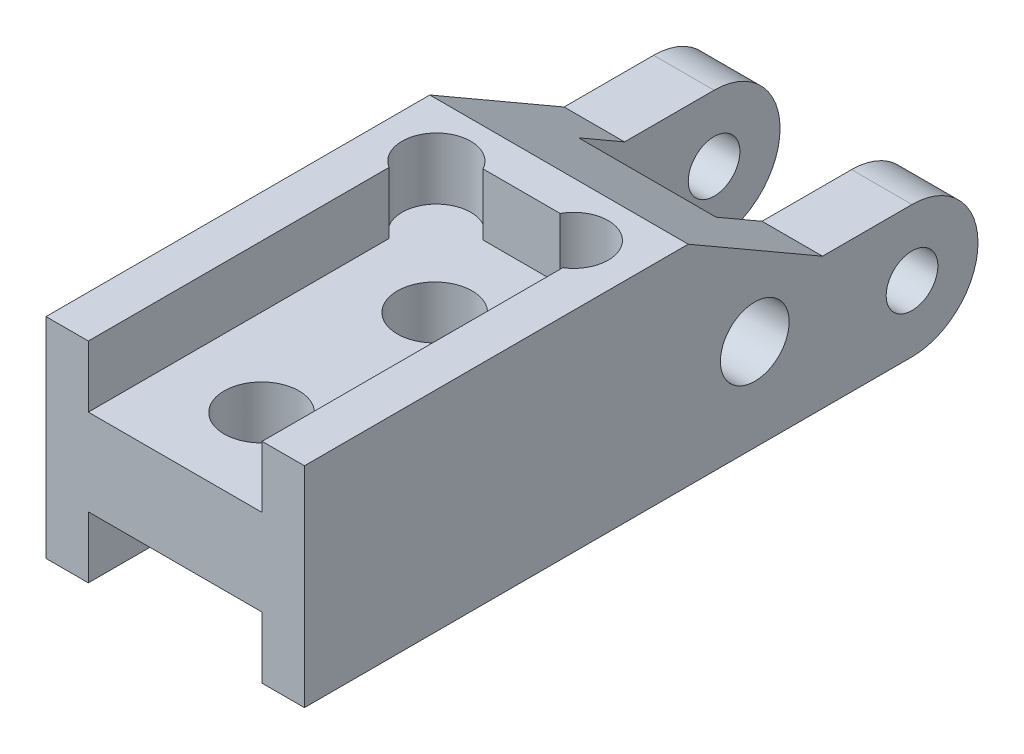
ISO-10303-21;
HEADER;
FILE_DESCRIPTION(('STEP AP214'),'2;1');
FILE_NAME('part.step','',(''),(''),'','','');
FILE_SCHEMA(('AUTOMOTIVE_DESIGN { 1 0 10303 214 1 1 1 1 }'));
ENDSEC;
DATA;
#1=APPLICATION_CONTEXT('core data for automotive mechanical design processes');
#2=APPLICATION_PROTOCOL_DEFINITION('international standard','automotive_design',2000,#1);
#3=PRODUCT_CONTEXT('',#1,'mechanical');
#4=PRODUCT('Part','Part','',(#3));
#5=PRODUCT_RELATED_PRODUCT_CATEGORY('part','',(#4));
#6=PRODUCT_DEFINITION_FORMATION('','',#4);
#7=PRODUCT_DEFINITION_CONTEXT('part definition',#1,'design');
#8=PRODUCT_DEFINITION('design','',#6,#7);
#9=PRODUCT_DEFINITION_SHAPE('','',#8);
#10=(LENGTH_UNIT() NAMED_UNIT(*) SI_UNIT(.MILLI.,.METRE.));
#11=(NAMED_UNIT(*) PLANE_ANGLE_UNIT() SI_UNIT($,.RADIAN.));
#12=(NAMED_UNIT(*) SI_UNIT($,.STERADIAN.) SOLID_ANGLE_UNIT());
#13=UNCERTAINTY_MEASURE_WITH_UNIT(LENGTH_MEASURE(1.E-05),#10,'distance_accuracy_value','');
#14=(GEOMETRIC_REPRESENTATION_CONTEXT(3) GLOBAL_UNCERTAINTY_ASSIGNED_CONTEXT((#13)) GLOBAL_UNIT_ASSIGNED_CONTEXT((#10,
#11,#12)) REPRESENTATION_CONTEXT('',''));
#15=CARTESIAN_POINT('',(0.,0.,0.));
#16=DIRECTION('',(0.,0.,1.));
#17=DIRECTION('',(1.,0.,0.));
#18=AXIS2_PLACEMENT_3D('',#15,#16,#17);
#19=CARTESIAN_POINT('',(-5.96899999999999,-4.8387,15.5575));
#20=DIRECTION('',(0.,1.,0.));
#21=DIRECTION('',(0.,0.,1.));
#22=AXIS2_PLACEMENT_3D('',#19,#20,#21);
#23=PLANE('',#22);
#24=DIRECTION('',(0.,0.,1.));
#25=VECTOR('',#24,1.);
#26=CARTESIAN_POINT('',(-4.0132,-4.8387,-0.444499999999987));
#27=LINE('',#26,#25);
#28=CARTESIAN_POINT('',(-4.0132,-4.8387,1.66567543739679));
#29=VERTEX_POINT('',#28);
#30=CARTESIAN_POINT('',(-4.0132,-4.8387,15.5575));
#31=VERTEX_POINT('',#30);
#32=EDGE_CURVE('E213',#29,#31,#27,.T.);
#33=ORIENTED_EDGE('',*,*,#32,.T.);
#34=DIRECTION('',(1.,0.,0.));
#35=VECTOR('',#34,1.);
#36=CARTESIAN_POINT('',(-5.96899999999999,-4.8387,15.5575));
#37=LINE('',#36,#35);
#38=CARTESIAN_POINT('',(-5.96899999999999,-4.8387,15.5575));
#39=VERTEX_POINT('',#38);
#40=EDGE_CURVE('E363',#39,#31,#37,.T.);
#41=ORIENTED_EDGE('',*,*,#40,.F.);
#42=DIRECTION('',(0.,0.,1.));
#43=VECTOR('',#42,1.);
#44=CARTESIAN_POINT('',(-5.969,-4.8387,-15.5575));
#45=LINE('',#44,#43);
#46=CARTESIAN_POINT('',(-5.969,-4.8387,-12.5095));
#47=VERTEX_POINT('',#46);
#48=EDGE_CURVE('E359',#47,#39,#45,.T.);
#49=ORIENTED_EDGE('',*,*,#48,.F.);
#50=DIRECTION('',(-1.,0.,0.));
#51=VECTOR('',#50,1.);
#52=CARTESIAN_POINT('',(-3.175,-4.8387,-12.5095));
#53=LINE('',#52,#51);
#54=CARTESIAN_POINT('',(-3.175,-4.8387,-12.5095));
#55=VERTEX_POINT('',#54);
#56=EDGE_CURVE('E58',#47,#55,#53,.F.);
#57=ORIENTED_EDGE('',*,*,#56,.T.);
#58=DIRECTION('',(0.,0.,1.));
#59=VECTOR('',#58,1.);
#60=CARTESIAN_POINT('',(-3.175,-4.8387,-15.5575));
#61=LINE('',#60,#59);
#62=CARTESIAN_POINT('',(-3.175,-4.8387,-10.4775));
#63=VERTEX_POINT('',#62);
#64=EDGE_CURVE('E298',#55,#63,#61,.T.);
#65=ORIENTED_EDGE('',*,*,#64,.T.);
#66=DIRECTION('',(-1.,0.,0.));
#67=VECTOR('',#66,1.);
#68=CARTESIAN_POINT('',(3.175,-4.8387,-10.4775));
#69=LINE('',#68,#67);
#70=CARTESIAN_POINT('',(3.175,-4.8387,-10.4775));
#71=VERTEX_POINT('',#70);
#72=EDGE_CURVE('E305',#71,#63,#69,.T.);
#73=ORIENTED_EDGE('',*,*,#72,.F.);
#74=DIRECTION('',(0.,0.,1.));
#75=VECTOR('',#74,1.);
#76=CARTESIAN_POINT('',(3.175,-4.8387,-15.5575));
#77=LINE('',#76,#75);
#78=CARTESIAN_POINT('',(3.175,-4.8387,-12.5095));
#79=VERTEX_POINT('',#78);
#80=EDGE_CURVE('E299',#79,#71,#77,.T.);
#81=ORIENTED_EDGE('',*,*,#80,.F.);
#82=DIRECTION('',(-1.,0.,0.));
#83=VECTOR('',#82,1.);
#84=CARTESIAN_POINT('',(5.969,-4.8387,-12.5095));
#85=LINE('',#84,#83);
#86=CARTESIAN_POINT('',(5.969,-4.8387,-12.5095));
#87=VERTEX_POINT('',#86);
#88=EDGE_CURVE('E399',#79,#87,#85,.F.);
#89=ORIENTED_EDGE('',*,*,#88,.T.);
#90=DIRECTION('',(0.,0.,-1.));
#91=VECTOR('',#90,1.);
#92=CARTESIAN_POINT('',(5.969,-4.8387,-15.5575));
#93=LINE('',#92,#91);
#94=CARTESIAN_POINT('',(5.969,-4.8387,15.5575));
#95=VERTEX_POINT('',#94);
#96=EDGE_CURVE('E366',#95,#87,#93,.T.);
#97=ORIENTED_EDGE('',*,*,#96,.F.);
#98=CARTESIAN_POINT('',(4.0132,-4.8387,15.5575));
#99=VERTEX_POINT('',#98);
#100=EDGE_CURVE('E361',#99,#95,#37,.T.);
#101=ORIENTED_EDGE('',*,*,#100,.F.);
#102=DIRECTION('',(0.,0.,-1.));
#103=VECTOR('',#102,1.);
#104=CARTESIAN_POINT('',(4.0132,-4.8387,-0.444499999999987));
#105=LINE('',#104,#103);
#106=CARTESIAN_POINT('',(4.0132,-4.8387,1.66567543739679));
#107=VERTEX_POINT('',#106);
#108=EDGE_CURVE('E212',#99,#107,#105,.T.);
#109=ORIENTED_EDGE('',*,*,#108,.T.);
#110=CARTESIAN_POINT('',(3.175,-4.8387,0.317500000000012));
#111=DIRECTION('',(0.,1.,0.));
#112=DIRECTION('',(0.,0.,1.));
#113=AXIS2_PLACEMENT_3D('',#110,#111,#112);
#114=CIRCLE('',#113,1.5875);
#115=CARTESIAN_POINT('',(1.78233627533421,-4.8387,-0.444499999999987));
#116=VERTEX_POINT('',#115);
#117=EDGE_CURVE('E219',#107,#116,#114,.T.);
#118=ORIENTED_EDGE('',*,*,#117,.T.);
#119=DIRECTION('',(-1.,0.,0.));
#120=VECTOR('',#119,1.);
#121=CARTESIAN_POINT('',(-4.0132,-4.8387,-0.444499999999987));
#122=LINE('',#121,#120);
#123=CARTESIAN_POINT('',(-1.78233627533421,-4.8387,-0.444499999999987));
#124=VERTEX_POINT('',#123);
#125=EDGE_CURVE('E202',#116,#124,#122,.T.);
#126=ORIENTED_EDGE('',*,*,#125,.T.);
#127=CARTESIAN_POINT('',(-3.175,-4.8387,0.317500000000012));
#128=DIRECTION('',(0.,1.,0.));
#129=DIRECTION('',(0.,0.,1.));
#130=AXIS2_PLACEMENT_3D('',#127,#128,#129);
#131=CIRCLE('',#130,1.5875);
#132=EDGE_CURVE('E228',#124,#29,#131,.T.);
#133=ORIENTED_EDGE('',*,*,#132,.T.);
#134=EDGE_LOOP('',(#33,#41,#49,#57,#65,#73,#81,#89,#97,#101,#109,#118,#126,#133));
#135=FACE_BOUND('',#134,.T.);
#136=ADVANCED_FACE('F35',(#135),#23,.F.);
#137=CARTESIAN_POINT('',(-5.96899999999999,-4.8387,15.5575));
#138=DIRECTION('',(0.,0.,1.));
#139=DIRECTION('',(1.,0.,0.));
#140=AXIS2_PLACEMENT_3D('',#137,#138,#139);
#141=PLANE('',#140);
#142=ORIENTED_EDGE('',*,*,#40,.T.);
#143=DIRECTION('',(0.,1.,0.));
#144=VECTOR('',#143,1.);
#145=CARTESIAN_POINT('',(-4.0132,-4.8387,15.5575));
#146=LINE('',#145,#144);
#147=CARTESIAN_POINT('',(-4.0132,-1.9939,15.5575));
#148=VERTEX_POINT('',#147);
#149=EDGE_CURVE('E226',#31,#148,#146,.T.);
#150=ORIENTED_EDGE('',*,*,#149,.T.);
#151=DIRECTION('',(1.,0.,0.));
#152=VECTOR('',#151,1.);
#153=CARTESIAN_POINT('',(-5.96899999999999,-1.9939,15.5575));
#154=LINE('',#153,#152);
#155=CARTESIAN_POINT('',(4.0132,-1.9939,15.5575));
#156=VERTEX_POINT('',#155);
#157=EDGE_CURVE('E459',#148,#156,#154,.T.);
#158=ORIENTED_EDGE('',*,*,#157,.T.);
#159=DIRECTION('',(0.,-1.,0.));
#160=VECTOR('',#159,1.);
#161=CARTESIAN_POINT('',(4.0132,-4.8387,15.5575));
#162=LINE('',#161,#160);
#163=EDGE_CURVE('E458',#156,#99,#162,.T.);
#164=ORIENTED_EDGE('',*,*,#163,.T.);
#165=ORIENTED_EDGE('',*,*,#100,.T.);
#166=DIRECTION('',(0.,1.,0.));
#167=VECTOR('',#166,1.);
#168=CARTESIAN_POINT('',(5.969,-4.8387,15.5575));
#169=LINE('',#168,#167);
#170=CARTESIAN_POINT('',(5.969,4.8387,15.5575));
#171=VERTEX_POINT('',#170);
#172=EDGE_CURVE('E377',#95,#171,#169,.T.);
#173=ORIENTED_EDGE('',*,*,#172,.T.);
#174=DIRECTION('',(1.,0.,0.));
#175=VECTOR('',#174,1.);
#176=CARTESIAN_POINT('',(-5.96899999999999,4.8387,15.5575));
#177=LINE('',#176,#175);
#178=CARTESIAN_POINT('',(4.0132,4.8387,15.5575));
#179=VERTEX_POINT('',#178);
#180=EDGE_CURVE('E371',#179,#171,#177,.T.);
#181=ORIENTED_EDGE('',*,*,#180,.F.);
#182=DIRECTION('',(0.,1.,0.));
#183=VECTOR('',#182,1.);
#184=CARTESIAN_POINT('',(4.0132,-4.8387,15.5575));
#185=LINE('',#184,#183);
#186=CARTESIAN_POINT('',(4.0132,1.9939,15.5575));
#187=VERTEX_POINT('',#186);
#188=EDGE_CURVE('E330',#187,#179,#185,.T.);
#189=ORIENTED_EDGE('',*,*,#188,.F.);
#190=DIRECTION('',(-1.,0.,0.));
#191=VECTOR('',#190,1.);
#192=CARTESIAN_POINT('',(-5.96899999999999,1.9939,15.5575));
#193=LINE('',#192,#191);
#194=CARTESIAN_POINT('',(-4.0132,1.9939,15.5575));
#195=VERTEX_POINT('',#194);
#196=EDGE_CURVE('E338',#187,#195,#193,.T.);
#197=ORIENTED_EDGE('',*,*,#196,.T.);
#198=DIRECTION('',(0.,-1.,0.));
#199=VECTOR('',#198,1.);
#200=CARTESIAN_POINT('',(-4.0132,-4.8387,15.5575));
#201=LINE('',#200,#199);
#202=CARTESIAN_POINT('',(-4.0132,4.8387,15.5575));
#203=VERTEX_POINT('',#202);
#204=EDGE_CURVE('E344',#203,#195,#201,.T.);
#205=ORIENTED_EDGE('',*,*,#204,.F.);
#206=CARTESIAN_POINT('',(-5.96899999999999,4.8387,15.5575));
#207=VERTEX_POINT('',#206);
#208=EDGE_CURVE('E372',#207,#203,#177,.T.);
#209=ORIENTED_EDGE('',*,*,#208,.F.);
#210=DIRECTION('',(0.,1.,0.));
#211=VECTOR('',#210,1.);
#212=CARTESIAN_POINT('',(-5.96899999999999,-4.8387,15.5575));
#213=LINE('',#212,#211);
#214=EDGE_CURVE('E369',#39,#207,#213,.T.);
#215=ORIENTED_EDGE('',*,*,#214,.F.);
#216=EDGE_LOOP('',(#142,#150,#158,#164,#165,#173,#181,#189,#197,#205,#209,#215));
#217=FACE_BOUND('',#216,.T.);
#218=ADVANCED_FACE('F455',(#217),#141,.T.);
#219=CARTESIAN_POINT('',(0.,-4.8387,3.56870000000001));
#220=DIRECTION('',(0.,-1.,0.));
#221=DIRECTION('',(0.,0.,-1.));
#222=AXIS2_PLACEMENT_3D('',#219,#220,#221);
#223=CYLINDRICAL_SURFACE('',#222,1.7272);
#224=CARTESIAN_POINT('',(0.,1.9939,3.56870000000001));
#225=DIRECTION('',(0.,1.,0.));
#226=DIRECTION('',(0.,0.,1.));
#227=AXIS2_PLACEMENT_3D('',#224,#225,#226);
#228=CIRCLE('',#227,1.7272);
#229=CARTESIAN_POINT('',(0.,1.9939,5.29590000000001));
#230=VERTEX_POINT('',#229);
#231=EDGE_CURVE('E325',#230,#230,#228,.T.);
#232=ORIENTED_EDGE('',*,*,#231,.T.);
#233=EDGE_LOOP('',(#232));
#234=FACE_BOUND('',#233,.T.);
#235=CARTESIAN_POINT('',(0.,-1.9939,3.56870000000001));
#236=DIRECTION('',(0.,-1.,0.));
#237=DIRECTION('',(0.,0.,-1.));
#238=AXIS2_PLACEMENT_3D('',#235,#236,#237);
#239=CIRCLE('',#238,1.7272);
#240=CARTESIAN_POINT('',(0.,-1.9939,1.84150000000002));
#241=VERTEX_POINT('',#240);
#242=EDGE_CURVE('E466',#241,#241,#239,.F.);
#243=ORIENTED_EDGE('',*,*,#242,.F.);
#244=EDGE_LOOP('',(#243));
#245=FACE_BOUND('',#244,.T.);
#246=ADVANCED_FACE('F517',(#234,#245),#223,.F.);
#247=CARTESIAN_POINT('',(0.,-4.8387,11.5697));
#248=DIRECTION('',(0.,-1.,0.));
#249=DIRECTION('',(0.,0.,-1.));
#250=AXIS2_PLACEMENT_3D('',#247,#248,#249);
#251=CYLINDRICAL_SURFACE('',#250,1.7272);
#252=CARTESIAN_POINT('',(0.,1.9939,11.5697));
#253=DIRECTION('',(0.,1.,0.));
#254=DIRECTION('',(0.,0.,1.));
#255=AXIS2_PLACEMENT_3D('',#252,#253,#254);
#256=CIRCLE('',#255,1.7272);
#257=CARTESIAN_POINT('',(0.,1.9939,13.2969));
#258=VERTEX_POINT('',#257);
#259=EDGE_CURVE('E311',#258,#258,#256,.T.);
#260=ORIENTED_EDGE('',*,*,#259,.T.);
#261=EDGE_LOOP('',(#260));
#262=FACE_BOUND('',#261,.T.);
#263=CARTESIAN_POINT('',(0.,-1.9939,11.5697));
#264=DIRECTION('',(0.,-1.,0.));
#265=DIRECTION('',(0.,0.,-1.));
#266=AXIS2_PLACEMENT_3D('',#263,#264,#265);
#267=CIRCLE('',#266,1.7272);
#268=CARTESIAN_POINT('',(0.,-1.9939,9.84250000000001));
#269=VERTEX_POINT('',#268);
#270=EDGE_CURVE('E462',#269,#269,#267,.F.);
#271=ORIENTED_EDGE('',*,*,#270,.F.);
#272=EDGE_LOOP('',(#271));
#273=FACE_BOUND('',#272,.T.);
#274=ADVANCED_FACE('F564',(#262,#273),#251,.F.);
#275=CARTESIAN_POINT('',(-3.175,-1.9939,0.317500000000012));
#276=DIRECTION('',(0.,-1.,0.));
#277=DIRECTION('',(0.,0.,-1.));
#278=AXIS2_PLACEMENT_3D('',#275,#276,#277);
#279=CYLINDRICAL_SURFACE('',#278,1.5875);
#280=CARTESIAN_POINT('',(-3.175,-1.9939,0.317500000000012));
#281=DIRECTION('',(0.,1.,0.));
#282=DIRECTION('',(0.,0.,1.));
#283=AXIS2_PLACEMENT_3D('',#280,#281,#282);
#284=CIRCLE('',#283,1.5875);
#285=CARTESIAN_POINT('',(-1.7823362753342,-1.9939,-0.444499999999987));
#286=VERTEX_POINT('',#285);
#287=CARTESIAN_POINT('',(-4.0132,-1.9939,1.66567543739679));
#288=VERTEX_POINT('',#287);
#289=EDGE_CURVE('E234',#286,#288,#284,.T.);
#290=ORIENTED_EDGE('',*,*,#289,.T.);
#291=DIRECTION('',(0.,-1.,0.));
#292=VECTOR('',#291,1.);
#293=CARTESIAN_POINT('',(-4.0132,-1.9939,1.66567543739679));
#294=LINE('',#293,#292);
#295=EDGE_CURVE('E231',#288,#29,#294,.T.);
#296=ORIENTED_EDGE('',*,*,#295,.T.);
#297=ORIENTED_EDGE('',*,*,#132,.F.);
#298=DIRECTION('',(0.,-1.,0.));
#299=VECTOR('',#298,1.);
#300=CARTESIAN_POINT('',(-1.78233627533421,-1.9939,-0.444499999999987));
#301=LINE('',#300,#299);
#302=EDGE_CURVE('E208',#124,#286,#301,.F.);
#303=ORIENTED_EDGE('',*,*,#302,.T.);
#304=EDGE_LOOP('',(#290,#296,#297,#303));
#305=FACE_BOUND('',#304,.T.);
#306=ADVANCED_FACE('F476',(#305),#279,.F.);
#307=CARTESIAN_POINT('',(3.175,-1.9939,0.317500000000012));
#308=DIRECTION('',(0.,-1.,0.));
#309=DIRECTION('',(0.,0.,-1.));
#310=AXIS2_PLACEMENT_3D('',#307,#308,#309);
#311=CYLINDRICAL_SURFACE('',#310,1.5875);
#312=ORIENTED_EDGE('',*,*,#117,.F.);
#313=DIRECTION('',(0.,-1.,0.));
#314=VECTOR('',#313,1.);
#315=CARTESIAN_POINT('',(4.0132,-1.9939,1.66567543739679));
#316=LINE('',#315,#314);
#317=CARTESIAN_POINT('',(4.0132,-1.9939,1.66567543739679));
#318=VERTEX_POINT('',#317);
#319=EDGE_CURVE('E463',#107,#318,#316,.F.);
#320=ORIENTED_EDGE('',*,*,#319,.T.);
#321=CARTESIAN_POINT('',(3.175,-1.9939,0.317500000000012));
#322=DIRECTION('',(0.,1.,0.));
#323=DIRECTION('',(0.,0.,1.));
#324=AXIS2_PLACEMENT_3D('',#321,#322,#323);
#325=CIRCLE('',#324,1.5875);
#326=CARTESIAN_POINT('',(1.78233627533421,-1.9939,-0.444499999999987));
#327=VERTEX_POINT('',#326);
#328=EDGE_CURVE('E220',#318,#327,#325,.T.);
#329=ORIENTED_EDGE('',*,*,#328,.T.);
#330=DIRECTION('',(0.,-1.,0.));
#331=VECTOR('',#330,1.);
#332=CARTESIAN_POINT('',(1.78233627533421,-1.9939,-0.444499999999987));
#333=LINE('',#332,#331);
#334=EDGE_CURVE('E205',#327,#116,#333,.T.);
#335=ORIENTED_EDGE('',*,*,#334,.T.);
#336=EDGE_LOOP('',(#312,#320,#329,#335));
#337=FACE_BOUND('',#336,.T.);
#338=ADVANCED_FACE('F217',(#337),#311,.F.);
#339=CARTESIAN_POINT('',(-5.969,-4.8387,-15.5575));
#340=DIRECTION('',(-1.,0.,0.));
#341=DIRECTION('',(0.,0.,1.));
#342=AXIS2_PLACEMENT_3D('',#339,#340,#341);
#343=PLANE('',#342);
#344=CARTESIAN_POINT('',(-5.969,-0.596899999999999,-5.24509999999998));
#345=DIRECTION('',(-1.,0.,0.));
#346=DIRECTION('',(0.,0.,1.));
#347=AXIS2_PLACEMENT_3D('',#344,#345,#346);
#348=CIRCLE('',#347,1.5875);
#349=CARTESIAN_POINT('',(-5.969,-0.596899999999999,-3.65759999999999));
#350=VERTEX_POINT('',#349);
#351=EDGE_CURVE('E237',#350,#350,#348,.T.);
#352=ORIENTED_EDGE('',*,*,#351,.F.);
#353=EDGE_LOOP('',(#352));
#354=FACE_BOUND('',#353,.T.);
#355=CARTESIAN_POINT('',(-5.969,-1.7907,-12.5095));
#356=DIRECTION('',(-1.,0.,0.));
#357=DIRECTION('',(0.,0.,1.));
#358=AXIS2_PLACEMENT_3D('',#355,#356,#357);
#359=CIRCLE('',#358,1.1938);
#360=CARTESIAN_POINT('',(-5.969,-1.7907,-11.3157));
#361=VERTEX_POINT('',#360);
#362=EDGE_CURVE('E242',#361,#361,#359,.T.);
#363=ORIENTED_EDGE('',*,*,#362,.F.);
#364=EDGE_LOOP('',(#363));
#365=FACE_BOUND('',#364,.T.);
#366=CARTESIAN_POINT('',(-5.969,-1.7907,-12.5095));
#367=DIRECTION('',(1.,0.,0.));
#368=DIRECTION('',(0.,0.,1.));
#369=AXIS2_PLACEMENT_3D('',#366,#367,#368);
#370=CIRCLE('',#369,3.048);
#371=CARTESIAN_POINT('',(-5.969,-1.7907,-15.5575));
#372=VERTEX_POINT('',#371);
#373=CARTESIAN_POINT('',(-5.969,1.2573,-12.5095));
#374=VERTEX_POINT('',#373);
#375=EDGE_CURVE('E254',#372,#374,#370,.T.);
#376=ORIENTED_EDGE('',*,*,#375,.F.);
#377=CARTESIAN_POINT('',(-5.969,-1.7907,-12.5095));
#378=DIRECTION('',(-1.,0.,0.));
#379=DIRECTION('',(0.,0.,1.));
#380=AXIS2_PLACEMENT_3D('',#377,#378,#379);
#381=CIRCLE('',#380,3.048);
#382=EDGE_CURVE('E43',#372,#47,#381,.T.);
#383=ORIENTED_EDGE('',*,*,#382,.T.);
#384=ORIENTED_EDGE('',*,*,#48,.T.);
#385=ORIENTED_EDGE('',*,*,#214,.T.);
#386=DIRECTION('',(0.,0.,1.));
#387=VECTOR('',#386,1.);
#388=CARTESIAN_POINT('',(-5.969,4.8387,-15.5575));
#389=LINE('',#388,#387);
#390=CARTESIAN_POINT('',(-5.969,4.8387,-2.17169999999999));
#391=VERTEX_POINT('',#390);
#392=EDGE_CURVE('E356',#391,#207,#389,.T.);
#393=ORIENTED_EDGE('',*,*,#392,.F.);
#394=DIRECTION('',(0.,0.499999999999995,0.866025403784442));
#395=VECTOR('',#394,1.);
#396=CARTESIAN_POINT('',(-5.969,4.8387,-2.17169999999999));
#397=LINE('',#396,#395);
#398=CARTESIAN_POINT('',(-5.969,1.2573,-8.37486676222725));
#399=VERTEX_POINT('',#398);
#400=EDGE_CURVE('E259',#399,#391,#397,.T.);
#401=ORIENTED_EDGE('',*,*,#400,.F.);
#402=DIRECTION('',(0.,0.,1.));
#403=VECTOR('',#402,1.);
#404=CARTESIAN_POINT('',(-5.969,1.2573,-12.5095));
#405=LINE('',#404,#403);
#406=EDGE_CURVE('E268',#374,#399,#405,.T.);
#407=ORIENTED_EDGE('',*,*,#406,.F.);
#408=EDGE_LOOP('',(#376,#383,#384,#385,#393,#401,#407));
#409=FACE_BOUND('',#408,.T.);
#410=ADVANCED_FACE('F404',(#354,#365,#409),#343,.T.);
#411=CARTESIAN_POINT('',(5.969,-4.8387,-15.5575));
#412=DIRECTION('',(1.,0.,0.));
#413=DIRECTION('',(0.,0.,-1.));
#414=AXIS2_PLACEMENT_3D('',#411,#412,#413);
#415=PLANE('',#414);
#416=CARTESIAN_POINT('',(5.969,-0.596899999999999,-5.24509999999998));
#417=DIRECTION('',(-1.,0.,0.));
#418=DIRECTION('',(0.,0.,1.));
#419=AXIS2_PLACEMENT_3D('',#416,#417,#418);
#420=CIRCLE('',#419,1.5875);
#421=CARTESIAN_POINT('',(5.969,-0.596899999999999,-3.65759999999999));
#422=VERTEX_POINT('',#421);
#423=EDGE_CURVE('E239',#422,#422,#420,.T.);
#424=ORIENTED_EDGE('',*,*,#423,.T.);
#425=EDGE_LOOP('',(#424));
#426=FACE_BOUND('',#425,.T.);
#427=CARTESIAN_POINT('',(5.969,-1.7907,-12.5095));
#428=DIRECTION('',(-1.,0.,0.));
#429=DIRECTION('',(0.,0.,1.));
#430=AXIS2_PLACEMENT_3D('',#427,#428,#429);
#431=CIRCLE('',#430,1.1938);
#432=CARTESIAN_POINT('',(5.969,-1.7907,-11.3157));
#433=VERTEX_POINT('',#432);
#434=EDGE_CURVE('E245',#433,#433,#431,.T.);
#435=ORIENTED_EDGE('',*,*,#434,.T.);
#436=EDGE_LOOP('',(#435));
#437=FACE_BOUND('',#436,.T.);
#438=ORIENTED_EDGE('',*,*,#96,.T.);
#439=CARTESIAN_POINT('',(5.969,-1.7907,-12.5095));
#440=DIRECTION('',(1.,0.,0.));
#441=DIRECTION('',(0.,0.,-1.));
#442=AXIS2_PLACEMENT_3D('',#439,#440,#441);
#443=CIRCLE('',#442,3.048);
#444=CARTESIAN_POINT('',(5.969,-1.7907,-15.5575));
#445=VERTEX_POINT('',#444);
#446=EDGE_CURVE('E401',#87,#445,#443,.T.);
#447=ORIENTED_EDGE('',*,*,#446,.T.);
#448=CARTESIAN_POINT('',(5.969,-1.7907,-12.5095));
#449=DIRECTION('',(1.,0.,0.));
#450=DIRECTION('',(0.,0.,1.));
#451=AXIS2_PLACEMENT_3D('',#448,#449,#450);
#452=CIRCLE('',#451,3.048);
#453=CARTESIAN_POINT('',(5.969,1.2573,-12.5095));
#454=VERTEX_POINT('',#453);
#455=EDGE_CURVE('E255',#445,#454,#452,.T.);
#456=ORIENTED_EDGE('',*,*,#455,.T.);
#457=DIRECTION('',(0.,0.,1.));
#458=VECTOR('',#457,1.);
#459=CARTESIAN_POINT('',(5.969,1.2573,-12.5095));
#460=LINE('',#459,#458);
#461=CARTESIAN_POINT('',(5.969,1.2573,-8.37486676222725));
#462=VERTEX_POINT('',#461);
#463=EDGE_CURVE('E258',#454,#462,#460,.T.);
#464=ORIENTED_EDGE('',*,*,#463,.T.);
#465=DIRECTION('',(0.,0.499999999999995,0.866025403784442));
#466=VECTOR('',#465,1.);
#467=CARTESIAN_POINT('',(5.969,4.8387,-2.17169999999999));
#468=LINE('',#467,#466);
#469=CARTESIAN_POINT('',(5.969,4.8387,-2.17169999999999));
#470=VERTEX_POINT('',#469);
#471=EDGE_CURVE('E262',#462,#470,#468,.T.);
#472=ORIENTED_EDGE('',*,*,#471,.T.);
#473=DIRECTION('',(0.,0.,-1.));
#474=VECTOR('',#473,1.);
#475=CARTESIAN_POINT('',(5.969,4.8387,-15.5575));
#476=LINE('',#475,#474);
#477=EDGE_CURVE('E362',#171,#470,#476,.T.);
#478=ORIENTED_EDGE('',*,*,#477,.F.);
#479=ORIENTED_EDGE('',*,*,#172,.F.);
#480=EDGE_LOOP('',(#438,#447,#456,#464,#472,#478,#479));
#481=FACE_BOUND('',#480,.T.);
#482=ADVANCED_FACE('F438',(#426,#437,#481),#415,.T.);
#483=CARTESIAN_POINT('',(-5.96899999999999,4.8387,15.5575));
#484=DIRECTION('',(0.,1.,0.));
#485=DIRECTION('',(0.,0.,1.));
#486=AXIS2_PLACEMENT_3D('',#483,#484,#485);
#487=PLANE('',#486);
#488=DIRECTION('',(-1.,0.,0.));
#489=VECTOR('',#488,1.);
#490=CARTESIAN_POINT('',(5.969,4.8387,-2.17169999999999));
#491=LINE('',#490,#489);
#492=EDGE_CURVE('E272',#470,#391,#491,.T.);
#493=ORIENTED_EDGE('',*,*,#492,.T.);
#494=ORIENTED_EDGE('',*,*,#392,.T.);
#495=ORIENTED_EDGE('',*,*,#208,.T.);
#496=DIRECTION('',(0.,0.,1.));
#497=VECTOR('',#496,1.);
#498=CARTESIAN_POINT('',(-4.0132,4.8387,-0.444499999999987));
#499=LINE('',#498,#497);
#500=CARTESIAN_POINT('',(-4.0132,4.8387,1.66567543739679));
#501=VERTEX_POINT('',#500);
#502=EDGE_CURVE('E322',#501,#203,#499,.T.);
#503=ORIENTED_EDGE('',*,*,#502,.F.);
#504=CARTESIAN_POINT('',(-3.175,4.8387,0.317500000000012));
#505=DIRECTION('',(0.,1.,0.));
#506=DIRECTION('',(0.,0.,1.));
#507=AXIS2_PLACEMENT_3D('',#504,#505,#506);
#508=CIRCLE('',#507,1.5875);
#509=CARTESIAN_POINT('',(-1.78233627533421,4.8387,-0.444499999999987));
#510=VERTEX_POINT('',#509);
#511=EDGE_CURVE('E350',#510,#501,#508,.T.);
#512=ORIENTED_EDGE('',*,*,#511,.F.);
#513=DIRECTION('',(-1.,0.,0.));
#514=VECTOR('',#513,1.);
#515=CARTESIAN_POINT('',(-4.0132,4.8387,-0.444499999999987));
#516=LINE('',#515,#514);
#517=CARTESIAN_POINT('',(1.78233627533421,4.8387,-0.444499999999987));
#518=VERTEX_POINT('',#517);
#519=EDGE_CURVE('E316',#518,#510,#516,.T.);
#520=ORIENTED_EDGE('',*,*,#519,.F.);
#521=CARTESIAN_POINT('',(3.175,4.8387,0.317500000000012));
#522=DIRECTION('',(0.,1.,0.));
#523=DIRECTION('',(0.,0.,1.));
#524=AXIS2_PLACEMENT_3D('',#521,#522,#523);
#525=CIRCLE('',#524,1.5875);
#526=CARTESIAN_POINT('',(4.0132,4.8387,1.66567543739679));
#527=VERTEX_POINT('',#526);
#528=EDGE_CURVE('E346',#527,#518,#525,.T.);
#529=ORIENTED_EDGE('',*,*,#528,.F.);
#530=DIRECTION('',(0.,0.,-1.));
#531=VECTOR('',#530,1.);
#532=CARTESIAN_POINT('',(4.0132,4.8387,-0.444499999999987));
#533=LINE('',#532,#531);
#534=EDGE_CURVE('E324',#179,#527,#533,.T.);
#535=ORIENTED_EDGE('',*,*,#534,.F.);
#536=ORIENTED_EDGE('',*,*,#180,.T.);
#537=ORIENTED_EDGE('',*,*,#477,.T.);
#538=EDGE_LOOP('',(#493,#494,#495,#503,#512,#520,#529,#535,#536,#537));
#539=FACE_BOUND('',#538,.T.);
#540=ADVANCED_FACE('F448',(#539),#487,.T.);
#541=CARTESIAN_POINT('',(-3.175,1.9939,0.317500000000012));
#542=DIRECTION('',(0.,1.,0.));
#543=DIRECTION('',(0.,0.,1.));
#544=AXIS2_PLACEMENT_3D('',#541,#542,#543);
#545=CYLINDRICAL_SURFACE('',#544,1.5875);
#546=ORIENTED_EDGE('',*,*,#511,.T.);
#547=DIRECTION('',(0.,1.,0.));
#548=VECTOR('',#547,1.);
#549=CARTESIAN_POINT('',(-4.0132,1.9939,1.66567543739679));
#550=LINE('',#549,#548);
#551=CARTESIAN_POINT('',(-4.0132,1.9939,1.66567543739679));
#552=VERTEX_POINT('',#551);
#553=EDGE_CURVE('E341',#501,#552,#550,.F.);
#554=ORIENTED_EDGE('',*,*,#553,.T.);
#555=CARTESIAN_POINT('',(-3.175,1.9939,0.317500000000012));
#556=DIRECTION('',(0.,1.,0.));
#557=DIRECTION('',(0.,0.,1.));
#558=AXIS2_PLACEMENT_3D('',#555,#556,#557);
#559=CIRCLE('',#558,1.5875);
#560=CARTESIAN_POINT('',(-1.7823362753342,1.9939,-0.444499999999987));
#561=VERTEX_POINT('',#560);
#562=EDGE_CURVE('E353',#561,#552,#559,.T.);
#563=ORIENTED_EDGE('',*,*,#562,.F.);
#564=DIRECTION('',(0.,1.,0.));
#565=VECTOR('',#564,1.);
#566=CARTESIAN_POINT('',(-1.78233627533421,1.9939,-0.444499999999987));
#567=LINE('',#566,#565);
#568=EDGE_CURVE('E335',#561,#510,#567,.T.);
#569=ORIENTED_EDGE('',*,*,#568,.T.);
#570=EDGE_LOOP('',(#546,#554,#563,#569));
#571=FACE_BOUND('',#570,.T.);
#572=ADVANCED_FACE('F489',(#571),#545,.F.);
#573=CARTESIAN_POINT('',(-3.175,1.9939,0.317500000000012));
#574=DIRECTION('',(0.,1.,0.));
#575=DIRECTION('',(0.,0.,1.));
#576=AXIS2_PLACEMENT_3D('',#573,#574,#575);
#577=PLANE('',#576);
#578=ORIENTED_EDGE('',*,*,#259,.F.);
#579=EDGE_LOOP('',(#578));
#580=FACE_BOUND('',#579,.T.);
#581=ORIENTED_EDGE('',*,*,#231,.F.);
#582=EDGE_LOOP('',(#581));
#583=FACE_BOUND('',#582,.T.);
#584=ORIENTED_EDGE('',*,*,#562,.T.);
#585=DIRECTION('',(0.,0.,1.));
#586=VECTOR('',#585,1.);
#587=CARTESIAN_POINT('',(-4.0132,1.9939,-0.444499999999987));
#588=LINE('',#587,#586);
#589=EDGE_CURVE('E312',#552,#195,#588,.T.);
#590=ORIENTED_EDGE('',*,*,#589,.T.);
#591=ORIENTED_EDGE('',*,*,#196,.F.);
#592=DIRECTION('',(0.,0.,-1.));
#593=VECTOR('',#592,1.);
#594=CARTESIAN_POINT('',(4.0132,1.9939,-0.444499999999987));
#595=LINE('',#594,#593);
#596=CARTESIAN_POINT('',(4.0132,1.9939,1.66567543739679));
#597=VERTEX_POINT('',#596);
#598=EDGE_CURVE('E315',#187,#597,#595,.T.);
#599=ORIENTED_EDGE('',*,*,#598,.T.);
#600=CARTESIAN_POINT('',(3.175,1.9939,0.317500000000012));
#601=DIRECTION('',(0.,1.,0.));
#602=DIRECTION('',(0.,0.,1.));
#603=AXIS2_PLACEMENT_3D('',#600,#601,#602);
#604=CIRCLE('',#603,1.5875);
#605=CARTESIAN_POINT('',(1.78233627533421,1.9939,-0.444499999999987));
#606=VERTEX_POINT('',#605);
#607=EDGE_CURVE('E347',#597,#606,#604,.T.);
#608=ORIENTED_EDGE('',*,*,#607,.T.);
#609=DIRECTION('',(-1.,0.,0.));
#610=VECTOR('',#609,1.);
#611=CARTESIAN_POINT('',(-4.0132,1.9939,-0.444499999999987));
#612=LINE('',#611,#610);
#613=EDGE_CURVE('E318',#606,#561,#612,.T.);
#614=ORIENTED_EDGE('',*,*,#613,.T.);
#615=EDGE_LOOP('',(#584,#590,#591,#599,#608,#614));
#616=FACE_BOUND('',#615,.T.);
#617=ADVANCED_FACE('F494',(#580,#583,#616),#577,.T.);
#618=CARTESIAN_POINT('',(3.175,1.9939,0.317500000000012));
#619=DIRECTION('',(0.,1.,0.));
#620=DIRECTION('',(0.,0.,1.));
#621=AXIS2_PLACEMENT_3D('',#618,#619,#620);
#622=CYLINDRICAL_SURFACE('',#621,1.5875);
#623=ORIENTED_EDGE('',*,*,#528,.T.);
#624=DIRECTION('',(0.,1.,0.));
#625=VECTOR('',#624,1.);
#626=CARTESIAN_POINT('',(1.78233627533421,1.9939,-0.444499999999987));
#627=LINE('',#626,#625);
#628=EDGE_CURVE('E332',#518,#606,#627,.F.);
#629=ORIENTED_EDGE('',*,*,#628,.T.);
#630=ORIENTED_EDGE('',*,*,#607,.F.);
#631=DIRECTION('',(0.,1.,0.));
#632=VECTOR('',#631,1.);
#633=CARTESIAN_POINT('',(4.0132,1.9939,1.66567543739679));
#634=LINE('',#633,#632);
#635=EDGE_CURVE('E321',#597,#527,#634,.T.);
#636=ORIENTED_EDGE('',*,*,#635,.T.);
#637=EDGE_LOOP('',(#623,#629,#630,#636));
#638=FACE_BOUND('',#637,.T.);
#639=ADVANCED_FACE('F499',(#638),#622,.F.);
#640=CARTESIAN_POINT('',(-4.0132,1.9939,-0.444499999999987));
#641=DIRECTION('',(-1.,0.,0.));
#642=DIRECTION('',(0.,0.,1.));
#643=AXIS2_PLACEMENT_3D('',#640,#641,#642);
#644=PLANE('',#643);
#645=ORIENTED_EDGE('',*,*,#204,.T.);
#646=ORIENTED_EDGE('',*,*,#589,.F.);
#647=ORIENTED_EDGE('',*,*,#553,.F.);
#648=ORIENTED_EDGE('',*,*,#502,.T.);
#649=EDGE_LOOP('',(#645,#646,#647,#648));
#650=FACE_BOUND('',#649,.T.);
#651=ADVANCED_FACE('F502',(#650),#644,.F.);
#652=CARTESIAN_POINT('',(-4.0132,1.9939,-0.444499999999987));
#653=DIRECTION('',(0.,0.,-1.));
#654=DIRECTION('',(-1.,0.,0.));
#655=AXIS2_PLACEMENT_3D('',#652,#653,#654);
#656=PLANE('',#655);
#657=ORIENTED_EDGE('',*,*,#613,.F.);
#658=ORIENTED_EDGE('',*,*,#628,.F.);
#659=ORIENTED_EDGE('',*,*,#519,.T.);
#660=ORIENTED_EDGE('',*,*,#568,.F.);
#661=EDGE_LOOP('',(#657,#658,#659,#660));
#662=FACE_BOUND('',#661,.T.);
#663=ADVANCED_FACE('F492',(#662),#656,.F.);
#664=CARTESIAN_POINT('',(4.0132,1.9939,-0.444499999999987));
#665=DIRECTION('',(1.,0.,0.));
#666=DIRECTION('',(0.,0.,-1.));
#667=AXIS2_PLACEMENT_3D('',#664,#665,#666);
#668=PLANE('',#667);
#669=ORIENTED_EDGE('',*,*,#188,.T.);
#670=ORIENTED_EDGE('',*,*,#534,.T.);
#671=ORIENTED_EDGE('',*,*,#635,.F.);
#672=ORIENTED_EDGE('',*,*,#598,.F.);
#673=EDGE_LOOP('',(#669,#670,#671,#672));
#674=FACE_BOUND('',#673,.T.);
#675=ADVANCED_FACE('F501',(#674),#668,.F.);
#676=CARTESIAN_POINT('',(3.175,-4.8387,-10.4775));
#677=DIRECTION('',(0.,-0.499999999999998,0.86602540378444));
#678=DIRECTION('',(0.,-0.86602540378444,-0.499999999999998));
#679=AXIS2_PLACEMENT_3D('',#676,#677,#678);
#680=PLANE('',#679);
#681=DIRECTION('',(0.,0.86602540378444,0.499999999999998));
#682=VECTOR('',#681,1.);
#683=CARTESIAN_POINT('',(-3.175,-4.8387,-10.4775));
#684=LINE('',#683,#682);
#685=CARTESIAN_POINT('',(-3.175,2.48436620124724,-6.24952575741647));
#686=VERTEX_POINT('',#685);
#687=EDGE_CURVE('E302',#63,#686,#684,.T.);
#688=ORIENTED_EDGE('',*,*,#687,.T.);
#689=DIRECTION('',(1.,0.,0.));
#690=VECTOR('',#689,1.);
#691=CARTESIAN_POINT('',(3.175,2.48436620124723,-6.24952575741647));
#692=LINE('',#691,#690);
#693=CARTESIAN_POINT('',(3.175,2.48436620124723,-6.24952575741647));
#694=VERTEX_POINT('',#693);
#695=EDGE_CURVE('E292',#686,#694,#692,.T.);
#696=ORIENTED_EDGE('',*,*,#695,.T.);
#697=DIRECTION('',(0.,0.86602540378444,0.499999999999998));
#698=VECTOR('',#697,1.);
#699=CARTESIAN_POINT('',(3.175,-4.8387,-10.4775));
#700=LINE('',#699,#698);
#701=EDGE_CURVE('E301',#71,#694,#700,.T.);
#702=ORIENTED_EDGE('',*,*,#701,.F.);
#703=ORIENTED_EDGE('',*,*,#72,.T.);
#704=EDGE_LOOP('',(#688,#696,#702,#703));
#705=FACE_BOUND('',#704,.T.);
#706=ADVANCED_FACE('F425',(#705),#680,.F.);
#707=CARTESIAN_POINT('',(3.175,4.8387,-15.5575));
#708=DIRECTION('',(1.,0.,0.));
#709=DIRECTION('',(0.,0.,-1.));
#710=AXIS2_PLACEMENT_3D('',#707,#708,#709);
#711=PLANE('',#710);
#712=CARTESIAN_POINT('',(3.175,-1.7907,-12.5095));
#713=DIRECTION('',(1.,0.,0.));
#714=DIRECTION('',(0.,0.,-1.));
#715=AXIS2_PLACEMENT_3D('',#712,#713,#714);
#716=CIRCLE('',#715,1.1938);
#717=CARTESIAN_POINT('',(3.175,-1.7907,-13.7033));
#718=VERTEX_POINT('',#717);
#719=EDGE_CURVE('E251',#718,#718,#716,.T.);
#720=ORIENTED_EDGE('',*,*,#719,.T.);
#721=EDGE_LOOP('',(#720));
#722=FACE_BOUND('',#721,.T.);
#723=CARTESIAN_POINT('',(3.175,-1.7907,-12.5095));
#724=DIRECTION('',(1.,0.,0.));
#725=DIRECTION('',(0.,0.,-1.));
#726=AXIS2_PLACEMENT_3D('',#723,#724,#725);
#727=CIRCLE('',#726,3.048);
#728=CARTESIAN_POINT('',(3.175,1.2573,-12.5095));
#729=VERTEX_POINT('',#728);
#730=CARTESIAN_POINT('',(3.175,-1.7907,-15.5575));
#731=VERTEX_POINT('',#730);
#732=EDGE_CURVE('E275',#729,#731,#727,.F.);
#733=ORIENTED_EDGE('',*,*,#732,.T.);
#734=CARTESIAN_POINT('',(3.175,-1.7907,-12.5095));
#735=DIRECTION('',(1.,0.,0.));
#736=DIRECTION('',(0.,0.,-1.));
#737=AXIS2_PLACEMENT_3D('',#734,#735,#736);
#738=CIRCLE('',#737,3.048);
#739=EDGE_CURVE('E394',#731,#79,#738,.F.);
#740=ORIENTED_EDGE('',*,*,#739,.T.);
#741=ORIENTED_EDGE('',*,*,#80,.T.);
#742=ORIENTED_EDGE('',*,*,#701,.T.);
#743=DIRECTION('',(0.,-0.499999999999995,-0.866025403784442));
#744=VECTOR('',#743,1.);
#745=CARTESIAN_POINT('',(3.175,-0.957521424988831,-12.2110500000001));
#746=LINE('',#745,#744);
#747=CARTESIAN_POINT('',(3.175,1.2573,-8.37486676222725));
#748=VERTEX_POINT('',#747);
#749=EDGE_CURVE('E295',#694,#748,#746,.T.);
#750=ORIENTED_EDGE('',*,*,#749,.T.);
#751=DIRECTION('',(0.,0.,-1.));
#752=VECTOR('',#751,1.);
#753=CARTESIAN_POINT('',(3.175,1.2573,-15.5575));
#754=LINE('',#753,#752);
#755=EDGE_CURVE('E289',#748,#729,#754,.T.);
#756=ORIENTED_EDGE('',*,*,#755,.T.);
#757=EDGE_LOOP('',(#733,#740,#741,#742,#750,#756));
#758=FACE_BOUND('',#757,.T.);
#759=ADVANCED_FACE('F555',(#722,#758),#711,.F.);
#760=CARTESIAN_POINT('',(-3.175,4.8387,-15.5575));
#761=DIRECTION('',(1.,0.,0.));
#762=DIRECTION('',(0.,0.,-1.));
#763=AXIS2_PLACEMENT_3D('',#760,#761,#762);
#764=PLANE('',#763);
#765=CARTESIAN_POINT('',(-3.175,-1.7907,-12.5095));
#766=DIRECTION('',(1.,0.,0.));
#767=DIRECTION('',(0.,0.,-1.));
#768=AXIS2_PLACEMENT_3D('',#765,#766,#767);
#769=CIRCLE('',#768,1.1938);
#770=CARTESIAN_POINT('',(-3.175,-1.7907,-13.7033));
#771=VERTEX_POINT('',#770);
#772=EDGE_CURVE('E248',#771,#771,#769,.T.);
#773=ORIENTED_EDGE('',*,*,#772,.F.);
#774=EDGE_LOOP('',(#773));
#775=FACE_BOUND('',#774,.T.);
#776=ORIENTED_EDGE('',*,*,#64,.F.);
#777=CARTESIAN_POINT('',(-3.175,-1.7907,-12.5095));
#778=DIRECTION('',(1.,0.,0.));
#779=DIRECTION('',(0.,0.,-1.));
#780=AXIS2_PLACEMENT_3D('',#777,#778,#779);
#781=CIRCLE('',#780,3.048);
#782=CARTESIAN_POINT('',(-3.175,-1.7907,-15.5575));
#783=VERTEX_POINT('',#782);
#784=EDGE_CURVE('E11',#55,#783,#781,.T.);
#785=ORIENTED_EDGE('',*,*,#784,.T.);
#786=CARTESIAN_POINT('',(-3.175,-1.7907,-12.5095));
#787=DIRECTION('',(1.,0.,0.));
#788=DIRECTION('',(0.,0.,-1.));
#789=AXIS2_PLACEMENT_3D('',#786,#787,#788);
#790=CIRCLE('',#789,3.048);
#791=CARTESIAN_POINT('',(-3.175,1.2573,-12.5095));
#792=VERTEX_POINT('',#791);
#793=EDGE_CURVE('E380',#792,#783,#790,.F.);
#794=ORIENTED_EDGE('',*,*,#793,.F.);
#795=DIRECTION('',(0.,0.,-1.));
#796=VECTOR('',#795,1.);
#797=CARTESIAN_POINT('',(-3.175,1.2573,-15.5575));
#798=LINE('',#797,#796);
#799=CARTESIAN_POINT('',(-3.175,1.2573,-8.37486676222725));
#800=VERTEX_POINT('',#799);
#801=EDGE_CURVE('E389',#800,#792,#798,.T.);
#802=ORIENTED_EDGE('',*,*,#801,.F.);
#803=DIRECTION('',(0.,-0.499999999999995,-0.866025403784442));
#804=VECTOR('',#803,1.);
#805=CARTESIAN_POINT('',(-3.175,-0.957521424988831,-12.2110500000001));
#806=LINE('',#805,#804);
#807=EDGE_CURVE('E392',#686,#800,#806,.T.);
#808=ORIENTED_EDGE('',*,*,#807,.F.);
#809=ORIENTED_EDGE('',*,*,#687,.F.);
#810=EDGE_LOOP('',(#776,#785,#794,#802,#808,#809));
#811=FACE_BOUND('',#810,.T.);
#812=ADVANCED_FACE('F414',(#775,#811),#764,.T.);
#813=CARTESIAN_POINT('',(5.969,4.8387,-2.17169999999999));
#814=DIRECTION('',(0.,-0.866025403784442,0.499999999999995));
#815=DIRECTION('',(0.,-0.499999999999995,-0.866025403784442));
#816=AXIS2_PLACEMENT_3D('',#813,#814,#815);
#817=PLANE('',#816);
#818=ORIENTED_EDGE('',*,*,#695,.F.);
#819=ORIENTED_EDGE('',*,*,#807,.T.);
#820=DIRECTION('',(-1.,0.,0.));
#821=VECTOR('',#820,1.);
#822=CARTESIAN_POINT('',(5.969,1.2573,-8.37486676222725));
#823=LINE('',#822,#821);
#824=EDGE_CURVE('E279',#800,#399,#823,.T.);
#825=ORIENTED_EDGE('',*,*,#824,.T.);
#826=ORIENTED_EDGE('',*,*,#400,.T.);
#827=ORIENTED_EDGE('',*,*,#492,.F.);
#828=ORIENTED_EDGE('',*,*,#471,.F.);
#829=EDGE_CURVE('E276',#462,#748,#823,.T.);
#830=ORIENTED_EDGE('',*,*,#829,.T.);
#831=ORIENTED_EDGE('',*,*,#749,.F.);
#832=EDGE_LOOP('',(#818,#819,#825,#826,#827,#828,#830,#831));
#833=FACE_BOUND('',#832,.T.);
#834=ADVANCED_FACE('F548',(#833),#817,.F.);
#835=CARTESIAN_POINT('',(5.969,1.2573,-12.5095));
#836=DIRECTION('',(0.,-1.,0.));
#837=DIRECTION('',(0.,0.,-1.));
#838=AXIS2_PLACEMENT_3D('',#835,#836,#837);
#839=PLANE('',#838);
#840=ORIENTED_EDGE('',*,*,#829,.F.);
#841=ORIENTED_EDGE('',*,*,#463,.F.);
#842=DIRECTION('',(-1.,0.,0.));
#843=VECTOR('',#842,1.);
#844=CARTESIAN_POINT('',(5.969,1.2573,-12.5095));
#845=LINE('',#844,#843);
#846=EDGE_CURVE('E280',#454,#729,#845,.T.);
#847=ORIENTED_EDGE('',*,*,#846,.T.);
#848=ORIENTED_EDGE('',*,*,#755,.F.);
#849=EDGE_LOOP('',(#840,#841,#847,#848));
#850=FACE_BOUND('',#849,.T.);
#851=ADVANCED_FACE('F444',(#850),#839,.F.);
#852=CARTESIAN_POINT('',(5.969,-1.7907,-12.5095));
#853=DIRECTION('',(-1.,0.,0.));
#854=DIRECTION('',(0.,0.,1.));
#855=AXIS2_PLACEMENT_3D('',#852,#853,#854);
#856=CYLINDRICAL_SURFACE('',#855,3.048);
#857=ORIENTED_EDGE('',*,*,#846,.F.);
#858=ORIENTED_EDGE('',*,*,#455,.F.);
#859=DIRECTION('',(-1.,0.,0.));
#860=VECTOR('',#859,1.);
#861=CARTESIAN_POINT('',(5.969,-1.7907,-15.5575));
#862=LINE('',#861,#860);
#863=EDGE_CURVE('E284',#445,#731,#862,.T.);
#864=ORIENTED_EDGE('',*,*,#863,.T.);
#865=ORIENTED_EDGE('',*,*,#732,.F.);
#866=EDGE_LOOP('',(#857,#858,#864,#865));
#867=FACE_BOUND('',#866,.T.);
#868=ADVANCED_FACE('F441',(#867),#856,.T.);
#869=ORIENTED_EDGE('',*,*,#801,.T.);
#870=EDGE_CURVE('E283',#792,#374,#845,.T.);
#871=ORIENTED_EDGE('',*,*,#870,.T.);
#872=ORIENTED_EDGE('',*,*,#406,.T.);
#873=ORIENTED_EDGE('',*,*,#824,.F.);
#874=EDGE_LOOP('',(#869,#871,#872,#873));
#875=FACE_BOUND('',#874,.T.);
#876=ADVANCED_FACE('F421',(#875),#839,.F.);
#877=ORIENTED_EDGE('',*,*,#793,.T.);
#878=EDGE_CURVE('E265',#783,#372,#862,.T.);
#879=ORIENTED_EDGE('',*,*,#878,.T.);
#880=ORIENTED_EDGE('',*,*,#375,.T.);
#881=ORIENTED_EDGE('',*,*,#870,.F.);
#882=EDGE_LOOP('',(#877,#879,#880,#881));
#883=FACE_BOUND('',#882,.T.);
#884=ADVANCED_FACE('F418',(#883),#856,.T.);
#885=CARTESIAN_POINT('',(5.969,-1.7907,-12.5095));
#886=DIRECTION('',(-1.,0.,0.));
#887=DIRECTION('',(0.,0.,1.));
#888=AXIS2_PLACEMENT_3D('',#885,#886,#887);
#889=CYLINDRICAL_SURFACE('',#888,1.1938);
#890=ORIENTED_EDGE('',*,*,#772,.T.);
#891=EDGE_LOOP('',(#890));
#892=FACE_BOUND('',#891,.T.);
#893=ORIENTED_EDGE('',*,*,#362,.T.);
#894=EDGE_LOOP('',(#893));
#895=FACE_BOUND('',#894,.T.);
#896=ADVANCED_FACE('F536',(#892,#895),#889,.F.);
#897=ORIENTED_EDGE('',*,*,#434,.F.);
#898=EDGE_LOOP('',(#897));
#899=FACE_BOUND('',#898,.T.);
#900=ORIENTED_EDGE('',*,*,#719,.F.);
#901=EDGE_LOOP('',(#900));
#902=FACE_BOUND('',#901,.T.);
#903=ADVANCED_FACE('F530',(#899,#902),#889,.F.);
#904=CARTESIAN_POINT('',(-5.969,-1.7907,-12.5095));
#905=DIRECTION('',(1.,0.,0.));
#906=DIRECTION('',(0.,0.,-1.));
#907=AXIS2_PLACEMENT_3D('',#904,#905,#906);
#908=CYLINDRICAL_SURFACE('',#907,3.048);
#909=ORIENTED_EDGE('',*,*,#446,.F.);
#910=ORIENTED_EDGE('',*,*,#88,.F.);
#911=ORIENTED_EDGE('',*,*,#739,.F.);
#912=ORIENTED_EDGE('',*,*,#863,.F.);
#913=EDGE_LOOP('',(#909,#910,#911,#912));
#914=FACE_BOUND('',#913,.T.);
#915=ADVANCED_FACE('F434',(#914),#908,.T.);
#916=CARTESIAN_POINT('',(-5.969,-1.7907,-12.5095));
#917=DIRECTION('',(1.,0.,0.));
#918=DIRECTION('',(0.,0.,-1.));
#919=AXIS2_PLACEMENT_3D('',#916,#917,#918);
#920=CYLINDRICAL_SURFACE('',#919,3.048);
#921=ORIENTED_EDGE('',*,*,#784,.F.);
#922=ORIENTED_EDGE('',*,*,#56,.F.);
#923=ORIENTED_EDGE('',*,*,#382,.F.);
#924=ORIENTED_EDGE('',*,*,#878,.F.);
#925=EDGE_LOOP('',(#921,#922,#923,#924));
#926=FACE_BOUND('',#925,.T.);
#927=ADVANCED_FACE('F37',(#926),#920,.T.);
#928=CARTESIAN_POINT('',(5.969,-0.596899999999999,-5.24509999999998));
#929=DIRECTION('',(-1.,0.,0.));
#930=DIRECTION('',(0.,0.,1.));
#931=AXIS2_PLACEMENT_3D('',#928,#929,#930);
#932=CYLINDRICAL_SURFACE('',#931,1.5875);
#933=ORIENTED_EDGE('',*,*,#423,.F.);
#934=EDGE_LOOP('',(#933));
#935=FACE_BOUND('',#934,.T.);
#936=ORIENTED_EDGE('',*,*,#351,.T.);
#937=EDGE_LOOP('',(#936));
#938=FACE_BOUND('',#937,.T.);
#939=ADVANCED_FACE('F535',(#935,#938),#932,.F.);
#940=CARTESIAN_POINT('',(-3.175,-1.9939,0.317500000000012));
#941=DIRECTION('',(0.,-1.,0.));
#942=DIRECTION('',(0.,0.,1.));
#943=AXIS2_PLACEMENT_3D('',#940,#941,#942);
#944=PLANE('',#943);
#945=ORIENTED_EDGE('',*,*,#289,.F.);
#946=DIRECTION('',(-1.,0.,0.));
#947=VECTOR('',#946,1.);
#948=CARTESIAN_POINT('',(-4.0132,-1.9939,-0.444499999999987));
#949=LINE('',#948,#947);
#950=EDGE_CURVE('E50',#327,#286,#949,.T.);
#951=ORIENTED_EDGE('',*,*,#950,.F.);
#952=ORIENTED_EDGE('',*,*,#328,.F.);
#953=DIRECTION('',(0.,0.,-1.));
#954=VECTOR('',#953,1.);
#955=CARTESIAN_POINT('',(4.0132,-1.9939,-0.444499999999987));
#956=LINE('',#955,#954);
#957=EDGE_CURVE('E221',#156,#318,#956,.T.);
#958=ORIENTED_EDGE('',*,*,#957,.F.);
#959=ORIENTED_EDGE('',*,*,#157,.F.);
#960=DIRECTION('',(0.,0.,1.));
#961=VECTOR('',#960,1.);
#962=CARTESIAN_POINT('',(-4.0132,-1.9939,-0.444499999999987));
#963=LINE('',#962,#961);
#964=EDGE_CURVE('E780',#288,#148,#963,.T.);
#965=ORIENTED_EDGE('',*,*,#964,.F.);
#966=EDGE_LOOP('',(#945,#951,#952,#958,#959,#965));
#967=FACE_BOUND('',#966,.T.);
#968=ORIENTED_EDGE('',*,*,#270,.T.);
#969=EDGE_LOOP('',(#968));
#970=FACE_BOUND('',#969,.T.);
#971=ORIENTED_EDGE('',*,*,#242,.T.);
#972=EDGE_LOOP('',(#971));
#973=FACE_BOUND('',#972,.T.);
#974=ADVANCED_FACE('F639',(#967,#970,#973),#944,.T.);
#975=CARTESIAN_POINT('',(-4.0132,-1.9939,-0.444499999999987));
#976=DIRECTION('',(1.,0.,0.));
#977=DIRECTION('',(0.,0.,-1.));
#978=AXIS2_PLACEMENT_3D('',#975,#976,#977);
#979=PLANE('',#978);
#980=ORIENTED_EDGE('',*,*,#32,.F.);
#981=ORIENTED_EDGE('',*,*,#295,.F.);
#982=ORIENTED_EDGE('',*,*,#964,.T.);
#983=ORIENTED_EDGE('',*,*,#149,.F.);
#984=EDGE_LOOP('',(#980,#981,#982,#983));
#985=FACE_BOUND('',#984,.T.);
#986=ADVANCED_FACE('F648',(#985),#979,.T.);
#987=CARTESIAN_POINT('',(4.0132,-1.9939,-0.444499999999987));
#988=DIRECTION('',(-1.,0.,0.));
#989=DIRECTION('',(0.,0.,1.));
#990=AXIS2_PLACEMENT_3D('',#987,#988,#989);
#991=PLANE('',#990);
#992=ORIENTED_EDGE('',*,*,#957,.T.);
#993=ORIENTED_EDGE('',*,*,#319,.F.);
#994=ORIENTED_EDGE('',*,*,#108,.F.);
#995=ORIENTED_EDGE('',*,*,#163,.F.);
#996=EDGE_LOOP('',(#992,#993,#994,#995));
#997=FACE_BOUND('',#996,.T.);
#998=ADVANCED_FACE('F773',(#997),#991,.T.);
#999=CARTESIAN_POINT('',(-4.0132,-1.9939,-0.444499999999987));
#1000=DIRECTION('',(0.,0.,1.));
#1001=DIRECTION('',(1.,0.,0.));
#1002=AXIS2_PLACEMENT_3D('',#999,#1000,#1001);
#1003=PLANE('',#1002);
#1004=ORIENTED_EDGE('',*,*,#125,.F.);
#1005=ORIENTED_EDGE('',*,*,#334,.F.);
#1006=ORIENTED_EDGE('',*,*,#950,.T.);
#1007=ORIENTED_EDGE('',*,*,#302,.F.);
#1008=EDGE_LOOP('',(#1004,#1005,#1006,#1007));
#1009=FACE_BOUND('',#1008,.T.);
#1010=ADVANCED_FACE('F204',(#1009),#1003,.T.);
#1011=CLOSED_SHELL('',(#136,#218,#246,#274,#306,#338,#410,#482,#540,#572,#617,#639,#651,#663,
#675,#706,#759,#812,#834,#851,#868,#876,#884,#896,#903,#915,#927,#939,#974,#986,#998,#1010));
#1012=MANIFOLD_SOLID_BREP('B2',#1011);
#1013=ADVANCED_BREP_SHAPE_REPRESENTATION('',(#18,#1012),#14);
#1014=SHAPE_DEFINITION_REPRESENTATION(#9,#1013);
ENDSEC;
END-ISO-10303-21;
